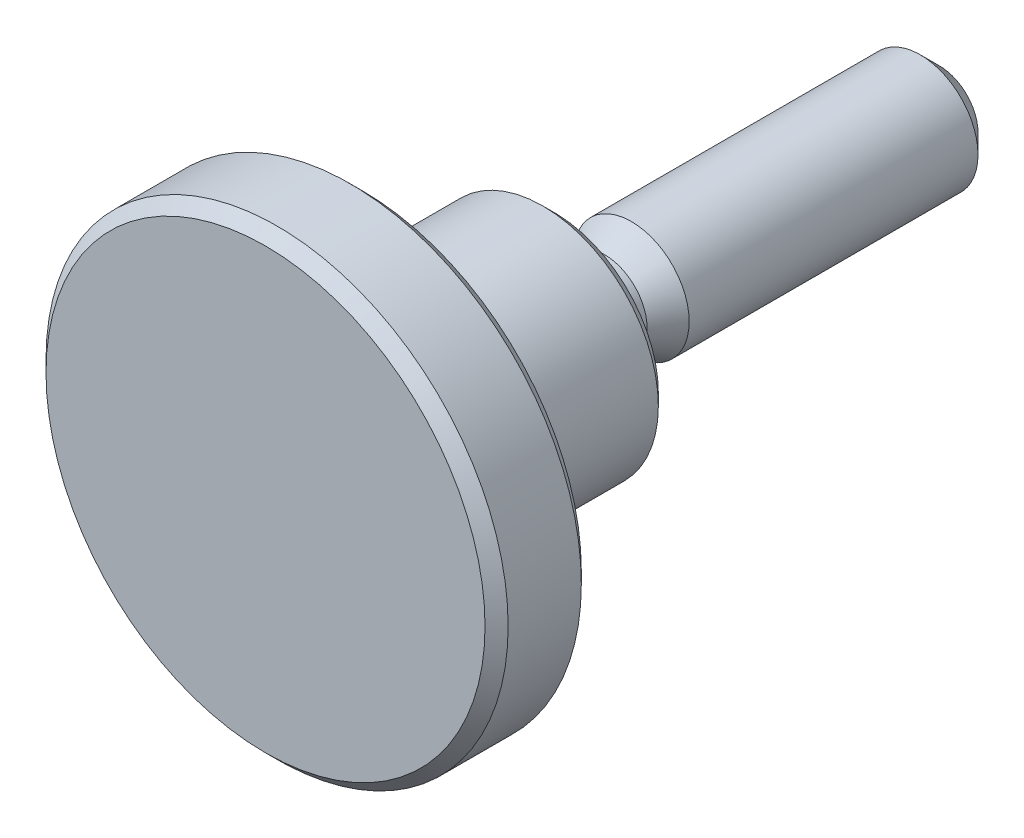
ISO-10303-21;
HEADER;
FILE_DESCRIPTION(('STEP AP214'),'2;1');
FILE_NAME('part.step','',(''),(''),'','','');
FILE_SCHEMA(('AUTOMOTIVE_DESIGN { 1 0 10303 214 1 1 1 1 }'));
ENDSEC;
DATA;
#1=APPLICATION_CONTEXT('core data for automotive mechanical design processes');
#2=APPLICATION_PROTOCOL_DEFINITION('international standard','automotive_design',2000,#1);
#3=PRODUCT_CONTEXT('',#1,'mechanical');
#4=PRODUCT('Part','Part','',(#3));
#5=PRODUCT_RELATED_PRODUCT_CATEGORY('part','',(#4));
#6=PRODUCT_DEFINITION_FORMATION('','',#4);
#7=PRODUCT_DEFINITION_CONTEXT('part definition',#1,'design');
#8=PRODUCT_DEFINITION('design','',#6,#7);
#9=PRODUCT_DEFINITION_SHAPE('','',#8);
#10=(LENGTH_UNIT() NAMED_UNIT(*) SI_UNIT(.MILLI.,.METRE.));
#11=(NAMED_UNIT(*) PLANE_ANGLE_UNIT() SI_UNIT($,.RADIAN.));
#12=(NAMED_UNIT(*) SI_UNIT($,.STERADIAN.) SOLID_ANGLE_UNIT());
#13=UNCERTAINTY_MEASURE_WITH_UNIT(LENGTH_MEASURE(1.E-05),#10,'distance_accuracy_value','');
#14=(GEOMETRIC_REPRESENTATION_CONTEXT(3) GLOBAL_UNCERTAINTY_ASSIGNED_CONTEXT((#13)) GLOBAL_UNIT_ASSIGNED_CONTEXT((#10,
#11,#12)) REPRESENTATION_CONTEXT('',''));
#15=CARTESIAN_POINT('',(0.,0.,0.));
#16=DIRECTION('',(0.,0.,1.));
#17=DIRECTION('',(1.,0.,0.));
#18=AXIS2_PLACEMENT_3D('',#15,#16,#17);
#19=CARTESIAN_POINT('',(0.,-1.11022302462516E-13,-9.9999999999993));
#20=DIRECTION('',(0.,0.,1.));
#21=DIRECTION('',(1.,0.,0.));
#22=AXIS2_PLACEMENT_3D('',#19,#20,#21);
#23=PLANE('',#22);
#24=CARTESIAN_POINT('',(0.,-1.11022302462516E-13,-9.99999999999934));
#25=DIRECTION('',(0.,0.,1.));
#26=DIRECTION('',(1.,0.,0.));
#27=AXIS2_PLACEMENT_3D('',#24,#25,#26);
#28=CIRCLE('',#27,1.00000287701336);
#29=CARTESIAN_POINT('',(1.00000287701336,-1.11022302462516E-13,-9.99999999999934));
#30=VERTEX_POINT('',#29);
#31=EDGE_CURVE('E8',#30,#30,#28,.T.);
#32=ORIENTED_EDGE('',*,*,#31,.F.);
#33=EDGE_LOOP('',(#32));
#34=FACE_BOUND('',#33,.T.);
#35=ADVANCED_FACE('F12',(#34),#23,.F.);
#36=CARTESIAN_POINT('',(0.,-1.11022302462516E-13,-9.99999999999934));
#37=DIRECTION('',(0.,0.,1.));
#38=DIRECTION('',(1.,0.,0.));
#39=AXIS2_PLACEMENT_3D('',#36,#37,#38);
#40=CONICAL_SURFACE('',#39,1.00000287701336,0.785398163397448);
#41=CARTESIAN_POINT('',(0.,-1.11022302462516E-13,-9.49999999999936));
#42=DIRECTION('',(0.,0.,1.));
#43=DIRECTION('',(1.,0.,0.));
#44=AXIS2_PLACEMENT_3D('',#41,#42,#43);
#45=CIRCLE('',#44,1.50000287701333);
#46=CARTESIAN_POINT('',(1.50000287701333,-1.11022302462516E-13,-9.49999999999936));
#47=VERTEX_POINT('',#46);
#48=EDGE_CURVE('E18',#47,#47,#45,.T.);
#49=ORIENTED_EDGE('',*,*,#48,.F.);
#50=EDGE_LOOP('',(#49));
#51=FACE_BOUND('',#50,.T.);
#52=ORIENTED_EDGE('',*,*,#31,.T.);
#53=EDGE_LOOP('',(#52));
#54=FACE_BOUND('',#53,.T.);
#55=ADVANCED_FACE('F132',(#51,#54),#40,.T.);
#56=CARTESIAN_POINT('',(0.,-1.11022302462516E-13,10.));
#57=DIRECTION('',(0.,0.,1.));
#58=DIRECTION('',(1.,0.,0.));
#59=AXIS2_PLACEMENT_3D('',#56,#57,#58);
#60=CYLINDRICAL_SURFACE('',#59,1.50000287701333);
#61=CARTESIAN_POINT('',(0.,-1.11022302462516E-13,-1.99999999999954));
#62=DIRECTION('',(0.,0.,1.));
#63=DIRECTION('',(1.,0.,0.));
#64=AXIS2_PLACEMENT_3D('',#61,#62,#63);
#65=CIRCLE('',#64,1.50000287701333);
#66=CARTESIAN_POINT('',(1.50000287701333,-1.11022302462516E-13,-1.99999999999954));
#67=VERTEX_POINT('',#66);
#68=EDGE_CURVE('E22',#67,#67,#65,.T.);
#69=ORIENTED_EDGE('',*,*,#68,.F.);
#70=EDGE_LOOP('',(#69));
#71=FACE_BOUND('',#70,.T.);
#72=ORIENTED_EDGE('',*,*,#48,.T.);
#73=EDGE_LOOP('',(#72));
#74=FACE_BOUND('',#73,.T.);
#75=ADVANCED_FACE('F127',(#71,#74),#60,.T.);
#76=CARTESIAN_POINT('',(0.,-1.11022302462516E-13,-1.99999999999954));
#77=DIRECTION('',(0.,0.,-1.));
#78=DIRECTION('',(-1.,0.,0.));
#79=AXIS2_PLACEMENT_3D('',#76,#77,#78);
#80=CONICAL_SURFACE('',#79,1.50000287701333,0.523598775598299);
#81=CARTESIAN_POINT('',(0.,-1.11022302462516E-13,-1.30717469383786));
#82=DIRECTION('',(0.,0.,1.));
#83=DIRECTION('',(1.,0.,0.));
#84=AXIS2_PLACEMENT_3D('',#81,#82,#83);
#85=CIRCLE('',#84,1.0999999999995);
#86=CARTESIAN_POINT('',(1.0999999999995,-1.11022302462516E-13,-1.30717469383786));
#87=VERTEX_POINT('',#86);
#88=EDGE_CURVE('E26',#87,#87,#85,.T.);
#89=ORIENTED_EDGE('',*,*,#88,.F.);
#90=EDGE_LOOP('',(#89));
#91=FACE_BOUND('',#90,.T.);
#92=ORIENTED_EDGE('',*,*,#68,.T.);
#93=EDGE_LOOP('',(#92));
#94=FACE_BOUND('',#93,.T.);
#95=ADVANCED_FACE('F121',(#91,#94),#80,.T.);
#96=CARTESIAN_POINT('',(0.,-1.11022302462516E-13,10.));
#97=DIRECTION('',(0.,0.,1.));
#98=DIRECTION('',(1.,0.,0.));
#99=AXIS2_PLACEMENT_3D('',#96,#97,#98);
#100=CYLINDRICAL_SURFACE('',#99,1.0999999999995);
#101=CARTESIAN_POINT('',(0.,-1.11022302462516E-13,-0.299999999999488));
#102=DIRECTION('',(0.,0.,1.));
#103=DIRECTION('',(1.,0.,0.));
#104=AXIS2_PLACEMENT_3D('',#101,#102,#103);
#105=CIRCLE('',#104,1.0999999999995);
#106=CARTESIAN_POINT('',(1.0999999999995,-1.11022302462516E-13,-0.299999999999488));
#107=VERTEX_POINT('',#106);
#108=EDGE_CURVE('E31',#107,#107,#105,.T.);
#109=ORIENTED_EDGE('',*,*,#108,.F.);
#110=EDGE_LOOP('',(#109));
#111=FACE_BOUND('',#110,.T.);
#112=ORIENTED_EDGE('',*,*,#88,.T.);
#113=EDGE_LOOP('',(#112));
#114=FACE_BOUND('',#113,.T.);
#115=ADVANCED_FACE('F115',(#111,#114),#100,.T.);
#116=CARTESIAN_POINT('',(0.,-1.11022302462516E-13,-0.299999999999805));
#117=DIRECTION('',(0.,0.,1.));
#118=DIRECTION('',(1.,0.,0.));
#119=AXIS2_PLACEMENT_3D('',#116,#117,#118);
#120=TOROIDAL_SURFACE('',#119,1.3999999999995,0.299999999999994);
#121=CARTESIAN_POINT('',(0.,-1.11022302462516E-13,1.89084858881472E-13));
#122=DIRECTION('',(0.,0.,1.));
#123=DIRECTION('',(1.,0.,0.));
#124=AXIS2_PLACEMENT_3D('',#121,#122,#123);
#125=CIRCLE('',#124,1.3999999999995);
#126=CARTESIAN_POINT('',(1.3999999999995,-1.11022302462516E-13,1.89084858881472E-13));
#127=VERTEX_POINT('',#126);
#128=EDGE_CURVE('E34',#127,#127,#125,.T.);
#129=ORIENTED_EDGE('',*,*,#128,.F.);
#130=EDGE_LOOP('',(#129));
#131=FACE_BOUND('',#130,.T.);
#132=ORIENTED_EDGE('',*,*,#108,.T.);
#133=EDGE_LOOP('',(#132));
#134=FACE_BOUND('',#133,.T.);
#135=ADVANCED_FACE('F109',(#131,#134),#120,.F.);
#136=CARTESIAN_POINT('',(0.,1.39999999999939,1.12106620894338E-13));
#137=DIRECTION('',(0.,0.,1.));
#138=DIRECTION('',(1.,0.,0.));
#139=AXIS2_PLACEMENT_3D('',#136,#137,#138);
#140=PLANE('',#139);
#141=CARTESIAN_POINT('',(0.,-1.11022302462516E-13,0.));
#142=DIRECTION('',(0.,0.,1.));
#143=DIRECTION('',(1.,0.,0.));
#144=AXIS2_PLACEMENT_3D('',#141,#142,#143);
#145=CIRCLE('',#144,2.7);
#146=CARTESIAN_POINT('',(2.7,-1.11022302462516E-13,0.));
#147=VERTEX_POINT('',#146);
#148=EDGE_CURVE('E37',#147,#147,#145,.T.);
#149=ORIENTED_EDGE('',*,*,#148,.F.);
#150=EDGE_LOOP('',(#149));
#151=FACE_BOUND('',#150,.T.);
#152=ORIENTED_EDGE('',*,*,#128,.T.);
#153=EDGE_LOOP('',(#152));
#154=FACE_BOUND('',#153,.T.);
#155=ADVANCED_FACE('F103',(#151,#154),#140,.F.);
#156=CARTESIAN_POINT('',(0.,-1.11022302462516E-13,0.));
#157=DIRECTION('',(0.,0.,1.));
#158=DIRECTION('',(1.,0.,0.));
#159=AXIS2_PLACEMENT_3D('',#156,#157,#158);
#160=CONICAL_SURFACE('',#159,2.7,0.785398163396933);
#161=CARTESIAN_POINT('',(0.,-1.11022302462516E-13,0.300000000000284));
#162=DIRECTION('',(0.,0.,1.));
#163=DIRECTION('',(1.,0.,0.));
#164=AXIS2_PLACEMENT_3D('',#161,#162,#163);
#165=CIRCLE('',#164,2.99999999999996);
#166=CARTESIAN_POINT('',(2.99999999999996,-1.11022302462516E-13,0.300000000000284));
#167=VERTEX_POINT('',#166);
#168=EDGE_CURVE('E40',#167,#167,#165,.T.);
#169=ORIENTED_EDGE('',*,*,#168,.F.);
#170=EDGE_LOOP('',(#169));
#171=FACE_BOUND('',#170,.T.);
#172=ORIENTED_EDGE('',*,*,#148,.T.);
#173=EDGE_LOOP('',(#172));
#174=FACE_BOUND('',#173,.T.);
#175=ADVANCED_FACE('F97',(#171,#174),#160,.T.);
#176=CARTESIAN_POINT('',(0.,-1.11022302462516E-13,10.));
#177=DIRECTION('',(0.,0.,1.));
#178=DIRECTION('',(1.,0.,0.));
#179=AXIS2_PLACEMENT_3D('',#176,#177,#178);
#180=CYLINDRICAL_SURFACE('',#179,2.99999999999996);
#181=CARTESIAN_POINT('',(0.,-1.11022302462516E-13,4.50000000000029));
#182=DIRECTION('',(0.,0.,1.));
#183=DIRECTION('',(1.,0.,0.));
#184=AXIS2_PLACEMENT_3D('',#181,#182,#183);
#185=CIRCLE('',#184,2.99999999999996);
#186=CARTESIAN_POINT('',(2.99999999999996,-1.11022302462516E-13,4.50000000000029));
#187=VERTEX_POINT('',#186);
#188=EDGE_CURVE('E43',#187,#187,#185,.T.);
#189=ORIENTED_EDGE('',*,*,#188,.F.);
#190=EDGE_LOOP('',(#189));
#191=FACE_BOUND('',#190,.T.);
#192=ORIENTED_EDGE('',*,*,#168,.T.);
#193=EDGE_LOOP('',(#192));
#194=FACE_BOUND('',#193,.T.);
#195=ADVANCED_FACE('F91',(#191,#194),#180,.T.);
#196=CARTESIAN_POINT('',(0.,-1.11022302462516E-13,4.5));
#197=DIRECTION('',(0.,0.,1.));
#198=DIRECTION('',(1.,0.,0.));
#199=AXIS2_PLACEMENT_3D('',#196,#197,#198);
#200=TOROIDAL_SURFACE('',#199,3.49999999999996,0.5);
#201=CARTESIAN_POINT('',(0.,-1.11022302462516E-13,5.));
#202=DIRECTION('',(0.,0.,1.));
#203=DIRECTION('',(1.,0.,0.));
#204=AXIS2_PLACEMENT_3D('',#201,#202,#203);
#205=CIRCLE('',#204,3.5);
#206=CARTESIAN_POINT('',(3.5,-1.11022302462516E-13,5.));
#207=VERTEX_POINT('',#206);
#208=EDGE_CURVE('E46',#207,#207,#205,.T.);
#209=ORIENTED_EDGE('',*,*,#208,.F.);
#210=EDGE_LOOP('',(#209));
#211=FACE_BOUND('',#210,.T.);
#212=ORIENTED_EDGE('',*,*,#188,.T.);
#213=EDGE_LOOP('',(#212));
#214=FACE_BOUND('',#213,.T.);
#215=ADVANCED_FACE('F85',(#211,#214),#200,.F.);
#216=CARTESIAN_POINT('',(0.,3.49999999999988,5.));
#217=DIRECTION('',(0.,0.,1.));
#218=DIRECTION('',(1.,0.,0.));
#219=AXIS2_PLACEMENT_3D('',#216,#217,#218);
#220=PLANE('',#219);
#221=CARTESIAN_POINT('',(0.,-1.11022302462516E-13,5.00000000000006));
#222=DIRECTION('',(0.,0.,1.));
#223=DIRECTION('',(1.,0.,0.));
#224=AXIS2_PLACEMENT_3D('',#221,#222,#223);
#225=CIRCLE('',#224,5.7);
#226=CARTESIAN_POINT('',(5.7,-1.11022302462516E-13,5.00000000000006));
#227=VERTEX_POINT('',#226);
#228=EDGE_CURVE('E49',#227,#227,#225,.T.);
#229=ORIENTED_EDGE('',*,*,#228,.F.);
#230=EDGE_LOOP('',(#229));
#231=FACE_BOUND('',#230,.T.);
#232=ORIENTED_EDGE('',*,*,#208,.T.);
#233=EDGE_LOOP('',(#232));
#234=FACE_BOUND('',#233,.T.);
#235=ADVANCED_FACE('F79',(#231,#234),#220,.F.);
#236=CARTESIAN_POINT('',(0.,-1.11022302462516E-13,5.00000000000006));
#237=DIRECTION('',(0.,0.,1.));
#238=DIRECTION('',(1.,0.,0.));
#239=AXIS2_PLACEMENT_3D('',#236,#237,#238);
#240=CONICAL_SURFACE('',#239,5.7,0.785398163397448);
#241=CARTESIAN_POINT('',(0.,-1.11022302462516E-13,5.30000000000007));
#242=DIRECTION('',(0.,0.,1.));
#243=DIRECTION('',(1.,0.,0.));
#244=AXIS2_PLACEMENT_3D('',#241,#242,#243);
#245=CIRCLE('',#244,6.);
#246=CARTESIAN_POINT('',(6.,-1.11022302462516E-13,5.30000000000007));
#247=VERTEX_POINT('',#246);
#248=EDGE_CURVE('E52',#247,#247,#245,.T.);
#249=ORIENTED_EDGE('',*,*,#248,.F.);
#250=EDGE_LOOP('',(#249));
#251=FACE_BOUND('',#250,.T.);
#252=ORIENTED_EDGE('',*,*,#228,.T.);
#253=EDGE_LOOP('',(#252));
#254=FACE_BOUND('',#253,.T.);
#255=ADVANCED_FACE('F73',(#251,#254),#240,.T.);
#256=CARTESIAN_POINT('',(0.,-1.11022302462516E-13,10.));
#257=DIRECTION('',(0.,0.,1.));
#258=DIRECTION('',(1.,0.,0.));
#259=AXIS2_PLACEMENT_3D('',#256,#257,#258);
#260=CYLINDRICAL_SURFACE('',#259,6.);
#261=CARTESIAN_POINT('',(0.,-1.11022302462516E-13,7.2));
#262=DIRECTION('',(0.,0.,1.));
#263=DIRECTION('',(1.,0.,0.));
#264=AXIS2_PLACEMENT_3D('',#261,#262,#263);
#265=CIRCLE('',#264,6.);
#266=CARTESIAN_POINT('',(6.,-1.11022302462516E-13,7.2));
#267=VERTEX_POINT('',#266);
#268=EDGE_CURVE('E55',#267,#267,#265,.T.);
#269=ORIENTED_EDGE('',*,*,#268,.F.);
#270=EDGE_LOOP('',(#269));
#271=FACE_BOUND('',#270,.T.);
#272=ORIENTED_EDGE('',*,*,#248,.T.);
#273=EDGE_LOOP('',(#272));
#274=FACE_BOUND('',#273,.T.);
#275=ADVANCED_FACE('F67',(#271,#274),#260,.T.);
#276=CARTESIAN_POINT('',(0.,-1.11022302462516E-13,7.2));
#277=DIRECTION('',(0.,0.,-1.));
#278=DIRECTION('',(-1.,0.,0.));
#279=AXIS2_PLACEMENT_3D('',#276,#277,#278);
#280=CONICAL_SURFACE('',#279,6.,0.785398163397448);
#281=CARTESIAN_POINT('',(0.,-1.11022302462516E-13,7.5));
#282=DIRECTION('',(0.,0.,1.));
#283=DIRECTION('',(1.,0.,0.));
#284=AXIS2_PLACEMENT_3D('',#281,#282,#283);
#285=CIRCLE('',#284,5.7);
#286=CARTESIAN_POINT('',(5.7,-1.11022302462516E-13,7.5));
#287=VERTEX_POINT('',#286);
#288=EDGE_CURVE('E58',#287,#287,#285,.T.);
#289=ORIENTED_EDGE('',*,*,#288,.F.);
#290=EDGE_LOOP('',(#289));
#291=FACE_BOUND('',#290,.T.);
#292=ORIENTED_EDGE('',*,*,#268,.T.);
#293=EDGE_LOOP('',(#292));
#294=FACE_BOUND('',#293,.T.);
#295=ADVANCED_FACE('F64',(#291,#294),#280,.T.);
#296=CARTESIAN_POINT('',(0.,-1.11022302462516E-13,7.5));
#297=DIRECTION('',(0.,0.,-1.));
#298=DIRECTION('',(-1.,0.,0.));
#299=AXIS2_PLACEMENT_3D('',#296,#297,#298);
#300=PLANE('',#299);
#301=ORIENTED_EDGE('',*,*,#288,.T.);
#302=EDGE_LOOP('',(#301));
#303=FACE_BOUND('',#302,.T.);
#304=ADVANCED_FACE('F62',(#303),#300,.F.);
#305=CLOSED_SHELL('',(#35,#55,#75,#95,#115,#135,#155,#175,#195,#215,#235,#255,#275,#295,#304));
#306=MANIFOLD_SOLID_BREP('B1',#305);
#307=ADVANCED_BREP_SHAPE_REPRESENTATION('',(#18,#306),#14);
#308=SHAPE_DEFINITION_REPRESENTATION(#9,#307);
ENDSEC;
END-ISO-10303-21;
